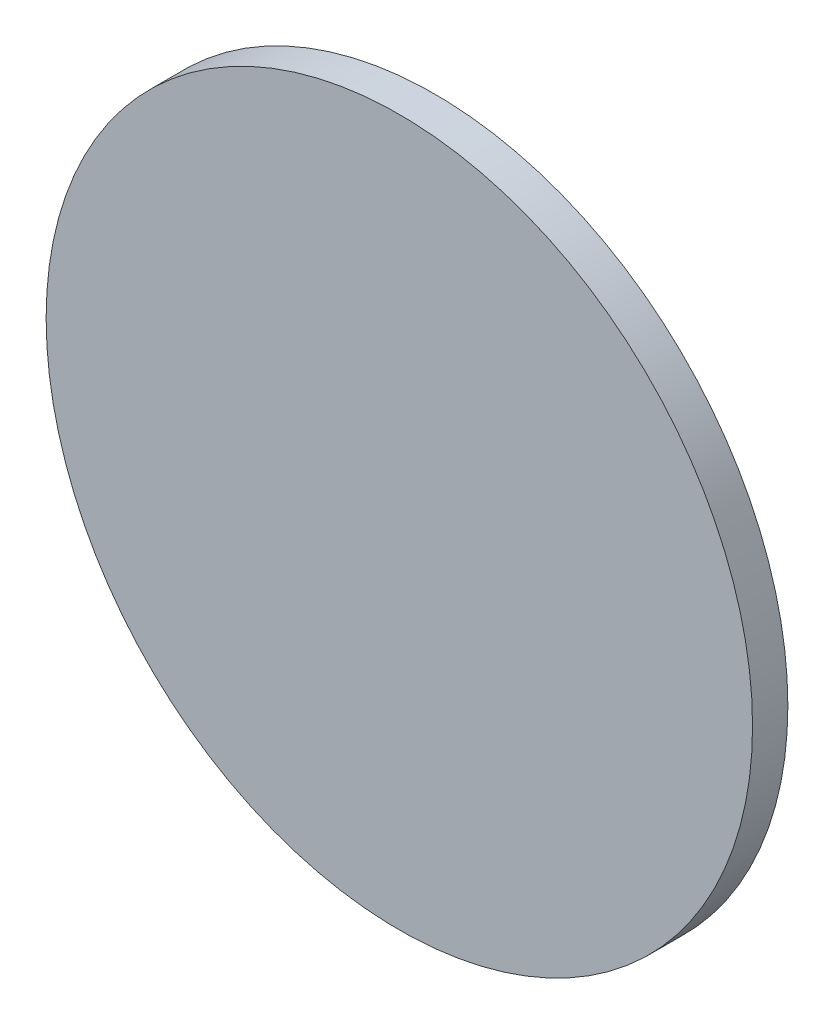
from build123d import *

# Parameters (mm, degrees)
SKETCH1_R           = 5
BOSS_EXTRUDE1_DEPTH = 0.5


with BuildPart() as part:
    # Sketch1 → Boss-Extrude1 (new body)
    with BuildSketch(Plane.XY):
        with Locations(Location((0, 0, 0), (0, 0, 180))):
            Circle(SKETCH1_R)
    extrude(amount=BOSS_EXTRUDE1_DEPTH)


solid = part.part
